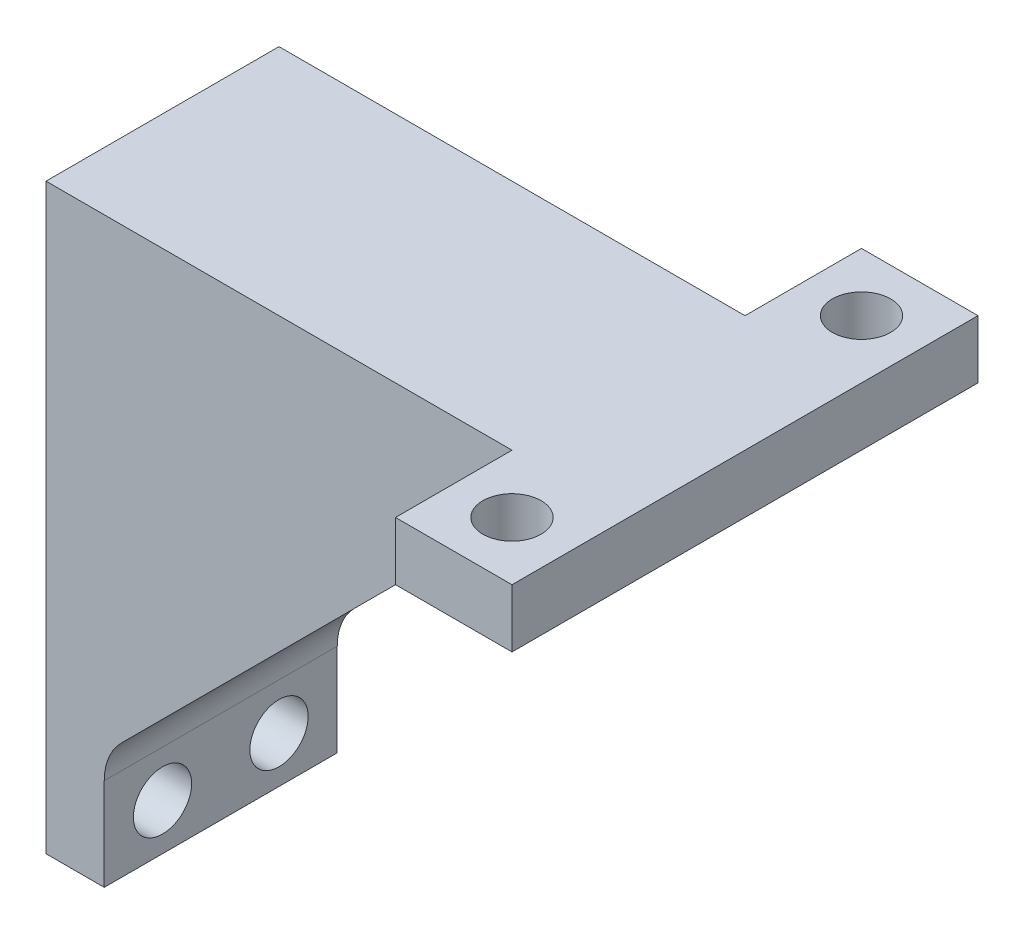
ISO-10303-21;
HEADER;
FILE_DESCRIPTION(('STEP AP214'),'2;1');
FILE_NAME('part.step','',(''),(''),'','','');
FILE_SCHEMA(('AUTOMOTIVE_DESIGN { 1 0 10303 214 1 1 1 1 }'));
ENDSEC;
DATA;
#1=APPLICATION_CONTEXT('core data for automotive mechanical design processes');
#2=APPLICATION_PROTOCOL_DEFINITION('international standard','automotive_design',2000,#1);
#3=PRODUCT_CONTEXT('',#1,'mechanical');
#4=PRODUCT('Part','Part','',(#3));
#5=PRODUCT_RELATED_PRODUCT_CATEGORY('part','',(#4));
#6=PRODUCT_DEFINITION_FORMATION('','',#4);
#7=PRODUCT_DEFINITION_CONTEXT('part definition',#1,'design');
#8=PRODUCT_DEFINITION('design','',#6,#7);
#9=PRODUCT_DEFINITION_SHAPE('','',#8);
#10=(LENGTH_UNIT() NAMED_UNIT(*) SI_UNIT(.MILLI.,.METRE.));
#11=(NAMED_UNIT(*) PLANE_ANGLE_UNIT() SI_UNIT($,.RADIAN.));
#12=(NAMED_UNIT(*) SI_UNIT($,.STERADIAN.) SOLID_ANGLE_UNIT());
#13=UNCERTAINTY_MEASURE_WITH_UNIT(LENGTH_MEASURE(1.E-05),#10,'distance_accuracy_value','');
#14=(GEOMETRIC_REPRESENTATION_CONTEXT(3) GLOBAL_UNCERTAINTY_ASSIGNED_CONTEXT((#13)) GLOBAL_UNIT_ASSIGNED_CONTEXT((#10,
#11,#12)) REPRESENTATION_CONTEXT('',''));
#15=CARTESIAN_POINT('',(0.,0.,0.));
#16=DIRECTION('',(0.,0.,1.));
#17=DIRECTION('',(1.,0.,0.));
#18=AXIS2_PLACEMENT_3D('',#15,#16,#17);
#19=CARTESIAN_POINT('',(70.,70.,40.));
#20=DIRECTION('',(-0.707106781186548,0.707106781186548,0.));
#21=DIRECTION('',(-0.707106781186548,-0.707106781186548,0.));
#22=AXIS2_PLACEMENT_3D('',#19,#20,#21);
#23=PLANE('',#22);
#24=DIRECTION('',(0.707106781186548,0.707106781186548,0.));
#25=VECTOR('',#24,1.);
#26=CARTESIAN_POINT('',(70.,70.,0.));
#27=LINE('',#26,#25);
#28=CARTESIAN_POINT('',(2.9289321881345,2.9289321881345,0.));
#29=VERTEX_POINT('',#28);
#30=CARTESIAN_POINT('',(67.0710678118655,67.0710678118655,0.));
#31=VERTEX_POINT('',#30);
#32=EDGE_CURVE('E208',#29,#31,#27,.T.);
#33=ORIENTED_EDGE('',*,*,#32,.T.);
#34=DIRECTION('',(0.,0.,-1.));
#35=VECTOR('',#34,1.);
#36=CARTESIAN_POINT('',(67.0710678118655,67.0710678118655,40.));
#37=LINE('',#36,#35);
#38=CARTESIAN_POINT('',(67.0710678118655,67.0710678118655,40.));
#39=VERTEX_POINT('',#38);
#40=EDGE_CURVE('E223',#31,#39,#37,.F.);
#41=ORIENTED_EDGE('',*,*,#40,.T.);
#42=DIRECTION('',(0.707106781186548,0.707106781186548,0.));
#43=VECTOR('',#42,1.);
#44=CARTESIAN_POINT('',(70.,70.,40.));
#45=LINE('',#44,#43);
#46=CARTESIAN_POINT('',(2.9289321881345,2.9289321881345,40.));
#47=VERTEX_POINT('',#46);
#48=EDGE_CURVE('E209',#47,#39,#45,.T.);
#49=ORIENTED_EDGE('',*,*,#48,.F.);
#50=DIRECTION('',(0.,0.,-1.));
#51=VECTOR('',#50,1.);
#52=CARTESIAN_POINT('',(2.92893218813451,2.92893218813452,0.));
#53=LINE('',#52,#51);
#54=EDGE_CURVE('E220',#47,#29,#53,.T.);
#55=ORIENTED_EDGE('',*,*,#54,.T.);
#56=EDGE_LOOP('',(#33,#41,#49,#55));
#57=FACE_BOUND('',#56,.T.);
#58=ADVANCED_FACE('F43',(#57),#23,.F.);
#59=CARTESIAN_POINT('',(0.,0.,40.));
#60=DIRECTION('',(0.,0.,-1.));
#61=DIRECTION('',(-1.,0.,0.));
#62=AXIS2_PLACEMENT_3D('',#59,#60,#61);
#63=PLANE('',#62);
#64=DIRECTION('',(0.,1.,0.));
#65=VECTOR('',#64,1.);
#66=CARTESIAN_POINT('',(0.,80.,40.));
#67=LINE('',#66,#65);
#68=CARTESIAN_POINT('',(0.,-20.,40.));
#69=VERTEX_POINT('',#68);
#70=CARTESIAN_POINT('',(0.,-4.14213562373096,40.));
#71=VERTEX_POINT('',#70);
#72=EDGE_CURVE('E156',#69,#71,#67,.T.);
#73=ORIENTED_EDGE('',*,*,#72,.T.);
#74=CARTESIAN_POINT('',(9.99999999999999,-4.14213562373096,40.));
#75=DIRECTION('',(0.,0.,-1.));
#76=DIRECTION('',(-1.,0.,0.));
#77=AXIS2_PLACEMENT_3D('',#74,#75,#76);
#78=CIRCLE('',#77,10.);
#79=EDGE_CURVE('E11',#71,#47,#78,.T.);
#80=ORIENTED_EDGE('',*,*,#79,.T.);
#81=ORIENTED_EDGE('',*,*,#48,.T.);
#82=CARTESIAN_POINT('',(74.142135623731,60.,40.));
#83=DIRECTION('',(0.,0.,-1.));
#84=DIRECTION('',(-1.,0.,0.));
#85=AXIS2_PLACEMENT_3D('',#82,#83,#84);
#86=CIRCLE('',#85,10.);
#87=CARTESIAN_POINT('',(74.142135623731,70.,40.));
#88=VERTEX_POINT('',#87);
#89=EDGE_CURVE('E229',#39,#88,#86,.T.);
#90=ORIENTED_EDGE('',*,*,#89,.T.);
#91=DIRECTION('',(1.,0.,0.));
#92=VECTOR('',#91,1.);
#93=CARTESIAN_POINT('',(0.,70.,40.));
#94=LINE('',#93,#92);
#95=CARTESIAN_POINT('',(70.,70.,40.));
#96=VERTEX_POINT('',#95);
#97=EDGE_CURVE('E58',#96,#88,#94,.T.);
#98=ORIENTED_EDGE('',*,*,#97,.F.);
#99=DIRECTION('',(0.,-1.,0.));
#100=VECTOR('',#99,1.);
#101=CARTESIAN_POINT('',(70.,80.,40.));
#102=LINE('',#101,#100);
#103=CARTESIAN_POINT('',(70.,80.,40.));
#104=VERTEX_POINT('',#103);
#105=EDGE_CURVE('E205',#104,#96,#102,.T.);
#106=ORIENTED_EDGE('',*,*,#105,.F.);
#107=DIRECTION('',(1.,0.,0.));
#108=VECTOR('',#107,1.);
#109=CARTESIAN_POINT('',(0.,80.,40.));
#110=LINE('',#109,#108);
#111=CARTESIAN_POINT('',(-10.,80.,40.));
#112=VERTEX_POINT('',#111);
#113=EDGE_CURVE('E168',#112,#104,#110,.T.);
#114=ORIENTED_EDGE('',*,*,#113,.F.);
#115=DIRECTION('',(0.,1.,0.));
#116=VECTOR('',#115,1.);
#117=CARTESIAN_POINT('',(-10.,80.,40.));
#118=LINE('',#117,#116);
#119=CARTESIAN_POINT('',(-10.,-20.,40.));
#120=VERTEX_POINT('',#119);
#121=EDGE_CURVE('E147',#120,#112,#118,.T.);
#122=ORIENTED_EDGE('',*,*,#121,.F.);
#123=DIRECTION('',(1.,0.,0.));
#124=VECTOR('',#123,1.);
#125=CARTESIAN_POINT('',(-10.,-20.,40.));
#126=LINE('',#125,#124);
#127=EDGE_CURVE('E143',#120,#69,#126,.T.);
#128=ORIENTED_EDGE('',*,*,#127,.T.);
#129=EDGE_LOOP('',(#73,#80,#81,#90,#98,#106,#114,#122,#128));
#130=FACE_BOUND('',#129,.T.);
#131=ADVANCED_FACE('F232',(#130),#63,.F.);
#132=CARTESIAN_POINT('',(0.,0.,0.));
#133=DIRECTION('',(0.,0.,-1.));
#134=DIRECTION('',(-1.,0.,0.));
#135=AXIS2_PLACEMENT_3D('',#132,#133,#134);
#136=PLANE('',#135);
#137=ORIENTED_EDGE('',*,*,#32,.F.);
#138=CARTESIAN_POINT('',(9.99999999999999,-4.14213562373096,0.));
#139=DIRECTION('',(0.,0.,-1.));
#140=DIRECTION('',(-1.,0.,0.));
#141=AXIS2_PLACEMENT_3D('',#138,#139,#140);
#142=CIRCLE('',#141,10.);
#143=CARTESIAN_POINT('',(0.,-4.14213562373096,0.));
#144=VERTEX_POINT('',#143);
#145=EDGE_CURVE('E51',#29,#144,#142,.F.);
#146=ORIENTED_EDGE('',*,*,#145,.T.);
#147=DIRECTION('',(0.,-1.,0.));
#148=VECTOR('',#147,1.);
#149=CARTESIAN_POINT('',(0.,80.,0.));
#150=LINE('',#149,#148);
#151=CARTESIAN_POINT('',(0.,-20.,0.));
#152=VERTEX_POINT('',#151);
#153=EDGE_CURVE('E159',#144,#152,#150,.T.);
#154=ORIENTED_EDGE('',*,*,#153,.T.);
#155=DIRECTION('',(1.,0.,0.));
#156=VECTOR('',#155,1.);
#157=CARTESIAN_POINT('',(-10.,-20.,0.));
#158=LINE('',#157,#156);
#159=CARTESIAN_POINT('',(-10.,-20.,0.));
#160=VERTEX_POINT('',#159);
#161=EDGE_CURVE('E141',#160,#152,#158,.T.);
#162=ORIENTED_EDGE('',*,*,#161,.F.);
#163=DIRECTION('',(0.,-1.,0.));
#164=VECTOR('',#163,1.);
#165=CARTESIAN_POINT('',(-10.,80.,0.));
#166=LINE('',#165,#164);
#167=CARTESIAN_POINT('',(-10.,80.,0.));
#168=VERTEX_POINT('',#167);
#169=EDGE_CURVE('E148',#168,#160,#166,.T.);
#170=ORIENTED_EDGE('',*,*,#169,.F.);
#171=DIRECTION('',(-1.,0.,0.));
#172=VECTOR('',#171,1.);
#173=CARTESIAN_POINT('',(0.,80.,0.));
#174=LINE('',#173,#172);
#175=CARTESIAN_POINT('',(70.,80.,0.));
#176=VERTEX_POINT('',#175);
#177=EDGE_CURVE('E181',#176,#168,#174,.T.);
#178=ORIENTED_EDGE('',*,*,#177,.F.);
#179=DIRECTION('',(0.,-1.,0.));
#180=VECTOR('',#179,1.);
#181=CARTESIAN_POINT('',(70.,80.,0.));
#182=LINE('',#181,#180);
#183=CARTESIAN_POINT('',(70.,70.,0.));
#184=VERTEX_POINT('',#183);
#185=EDGE_CURVE('E182',#176,#184,#182,.T.);
#186=ORIENTED_EDGE('',*,*,#185,.T.);
#187=DIRECTION('',(-1.,0.,0.));
#188=VECTOR('',#187,1.);
#189=CARTESIAN_POINT('',(0.,70.,0.));
#190=LINE('',#189,#188);
#191=CARTESIAN_POINT('',(74.142135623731,70.,0.));
#192=VERTEX_POINT('',#191);
#193=EDGE_CURVE('E218',#192,#184,#190,.T.);
#194=ORIENTED_EDGE('',*,*,#193,.F.);
#195=CARTESIAN_POINT('',(74.142135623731,60.,0.));
#196=DIRECTION('',(0.,0.,-1.));
#197=DIRECTION('',(-1.,0.,0.));
#198=AXIS2_PLACEMENT_3D('',#195,#196,#197);
#199=CIRCLE('',#198,10.);
#200=EDGE_CURVE('E227',#192,#31,#199,.F.);
#201=ORIENTED_EDGE('',*,*,#200,.T.);
#202=EDGE_LOOP('',(#137,#146,#154,#162,#170,#178,#186,#194,#201));
#203=FACE_BOUND('',#202,.T.);
#204=ADVANCED_FACE('F158',(#203),#136,.T.);
#205=CARTESIAN_POINT('',(0.,70.,0.));
#206=DIRECTION('',(0.,1.,0.));
#207=DIRECTION('',(0.,0.,1.));
#208=AXIS2_PLACEMENT_3D('',#205,#206,#207);
#209=PLANE('',#208);
#210=CARTESIAN_POINT('',(80.,70.,-10.));
#211=DIRECTION('',(0.,-1.,0.));
#212=DIRECTION('',(0.,0.,-1.));
#213=AXIS2_PLACEMENT_3D('',#210,#211,#212);
#214=CIRCLE('',#213,5.);
#215=CARTESIAN_POINT('',(80.,70.,-15.));
#216=VERTEX_POINT('',#215);
#217=EDGE_CURVE('E437',#216,#216,#214,.T.);
#218=ORIENTED_EDGE('',*,*,#217,.F.);
#219=EDGE_LOOP('',(#218));
#220=FACE_BOUND('',#219,.T.);
#221=CARTESIAN_POINT('',(80.,70.,50.));
#222=DIRECTION('',(0.,-1.,0.));
#223=DIRECTION('',(0.,0.,-1.));
#224=AXIS2_PLACEMENT_3D('',#221,#222,#223);
#225=CIRCLE('',#224,5.00000000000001);
#226=CARTESIAN_POINT('',(80.,70.,45.));
#227=VERTEX_POINT('',#226);
#228=EDGE_CURVE('E440',#227,#227,#225,.T.);
#229=ORIENTED_EDGE('',*,*,#228,.F.);
#230=EDGE_LOOP('',(#229));
#231=FACE_BOUND('',#230,.T.);
#232=DIRECTION('',(0.,0.,-1.));
#233=VECTOR('',#232,1.);
#234=CARTESIAN_POINT('',(74.142135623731,70.,0.));
#235=LINE('',#234,#233);
#236=EDGE_CURVE('E215',#88,#192,#235,.T.);
#237=ORIENTED_EDGE('',*,*,#236,.T.);
#238=ORIENTED_EDGE('',*,*,#193,.T.);
#239=DIRECTION('',(0.,0.,1.));
#240=VECTOR('',#239,1.);
#241=CARTESIAN_POINT('',(70.,70.,-20.));
#242=LINE('',#241,#240);
#243=CARTESIAN_POINT('',(70.,70.,-20.));
#244=VERTEX_POINT('',#243);
#245=EDGE_CURVE('E171',#244,#184,#242,.T.);
#246=ORIENTED_EDGE('',*,*,#245,.F.);
#247=DIRECTION('',(-1.,0.,0.));
#248=VECTOR('',#247,1.);
#249=CARTESIAN_POINT('',(90.,70.,-20.));
#250=LINE('',#249,#248);
#251=CARTESIAN_POINT('',(90.,70.,-20.));
#252=VERTEX_POINT('',#251);
#253=EDGE_CURVE('E187',#252,#244,#250,.T.);
#254=ORIENTED_EDGE('',*,*,#253,.F.);
#255=DIRECTION('',(0.,0.,-1.));
#256=VECTOR('',#255,1.);
#257=CARTESIAN_POINT('',(90.,70.,-20.));
#258=LINE('',#257,#256);
#259=CARTESIAN_POINT('',(90.,70.,60.));
#260=VERTEX_POINT('',#259);
#261=EDGE_CURVE('E185',#260,#252,#258,.T.);
#262=ORIENTED_EDGE('',*,*,#261,.F.);
#263=DIRECTION('',(1.,0.,0.));
#264=VECTOR('',#263,1.);
#265=CARTESIAN_POINT('',(90.,70.,60.));
#266=LINE('',#265,#264);
#267=CARTESIAN_POINT('',(70.,70.,60.));
#268=VERTEX_POINT('',#267);
#269=EDGE_CURVE('E163',#268,#260,#266,.T.);
#270=ORIENTED_EDGE('',*,*,#269,.F.);
#271=DIRECTION('',(0.,0.,1.));
#272=VECTOR('',#271,1.);
#273=CARTESIAN_POINT('',(70.,70.,40.));
#274=LINE('',#273,#272);
#275=EDGE_CURVE('E161',#96,#268,#274,.T.);
#276=ORIENTED_EDGE('',*,*,#275,.F.);
#277=ORIENTED_EDGE('',*,*,#97,.T.);
#278=EDGE_LOOP('',(#237,#238,#246,#254,#262,#270,#276,#277));
#279=FACE_BOUND('',#278,.T.);
#280=ADVANCED_FACE('F238',(#220,#231,#279),#209,.F.);
#281=CARTESIAN_POINT('',(70.,80.,40.));
#282=DIRECTION('',(1.,0.,0.));
#283=DIRECTION('',(0.,0.,-1.));
#284=AXIS2_PLACEMENT_3D('',#281,#282,#283);
#285=PLANE('',#284);
#286=ORIENTED_EDGE('',*,*,#275,.T.);
#287=DIRECTION('',(0.,-1.,0.));
#288=VECTOR('',#287,1.);
#289=CARTESIAN_POINT('',(70.,80.,60.));
#290=LINE('',#289,#288);
#291=CARTESIAN_POINT('',(70.,80.,60.));
#292=VERTEX_POINT('',#291);
#293=EDGE_CURVE('E202',#292,#268,#290,.T.);
#294=ORIENTED_EDGE('',*,*,#293,.F.);
#295=DIRECTION('',(0.,0.,1.));
#296=VECTOR('',#295,1.);
#297=CARTESIAN_POINT('',(70.,80.,40.));
#298=LINE('',#297,#296);
#299=EDGE_CURVE('E170',#104,#292,#298,.T.);
#300=ORIENTED_EDGE('',*,*,#299,.F.);
#301=ORIENTED_EDGE('',*,*,#105,.T.);
#302=EDGE_LOOP('',(#286,#294,#300,#301));
#303=FACE_BOUND('',#302,.T.);
#304=ADVANCED_FACE('F264',(#303),#285,.F.);
#305=CARTESIAN_POINT('',(90.,80.,60.));
#306=DIRECTION('',(0.,0.,-1.));
#307=DIRECTION('',(-1.,0.,0.));
#308=AXIS2_PLACEMENT_3D('',#305,#306,#307);
#309=PLANE('',#308);
#310=ORIENTED_EDGE('',*,*,#269,.T.);
#311=DIRECTION('',(0.,-1.,0.));
#312=VECTOR('',#311,1.);
#313=CARTESIAN_POINT('',(90.,80.,60.));
#314=LINE('',#313,#312);
#315=CARTESIAN_POINT('',(90.,80.,60.));
#316=VERTEX_POINT('',#315);
#317=EDGE_CURVE('E199',#316,#260,#314,.T.);
#318=ORIENTED_EDGE('',*,*,#317,.F.);
#319=DIRECTION('',(1.,0.,0.));
#320=VECTOR('',#319,1.);
#321=CARTESIAN_POINT('',(90.,80.,60.));
#322=LINE('',#321,#320);
#323=EDGE_CURVE('E173',#292,#316,#322,.T.);
#324=ORIENTED_EDGE('',*,*,#323,.F.);
#325=ORIENTED_EDGE('',*,*,#293,.T.);
#326=EDGE_LOOP('',(#310,#318,#324,#325));
#327=FACE_BOUND('',#326,.T.);
#328=ADVANCED_FACE('F260',(#327),#309,.F.);
#329=CARTESIAN_POINT('',(90.,80.,-20.));
#330=DIRECTION('',(-1.,0.,0.));
#331=DIRECTION('',(0.,0.,1.));
#332=AXIS2_PLACEMENT_3D('',#329,#330,#331);
#333=PLANE('',#332);
#334=ORIENTED_EDGE('',*,*,#261,.T.);
#335=DIRECTION('',(0.,-1.,0.));
#336=VECTOR('',#335,1.);
#337=CARTESIAN_POINT('',(90.,80.,-20.));
#338=LINE('',#337,#336);
#339=CARTESIAN_POINT('',(90.,80.,-20.));
#340=VERTEX_POINT('',#339);
#341=EDGE_CURVE('E196',#340,#252,#338,.T.);
#342=ORIENTED_EDGE('',*,*,#341,.F.);
#343=DIRECTION('',(0.,0.,-1.));
#344=VECTOR('',#343,1.);
#345=CARTESIAN_POINT('',(90.,80.,-20.));
#346=LINE('',#345,#344);
#347=EDGE_CURVE('E175',#316,#340,#346,.T.);
#348=ORIENTED_EDGE('',*,*,#347,.F.);
#349=ORIENTED_EDGE('',*,*,#317,.T.);
#350=EDGE_LOOP('',(#334,#342,#348,#349));
#351=FACE_BOUND('',#350,.T.);
#352=ADVANCED_FACE('F255',(#351),#333,.F.);
#353=CARTESIAN_POINT('',(90.,80.,-20.));
#354=DIRECTION('',(0.,0.,1.));
#355=DIRECTION('',(1.,0.,0.));
#356=AXIS2_PLACEMENT_3D('',#353,#354,#355);
#357=PLANE('',#356);
#358=ORIENTED_EDGE('',*,*,#253,.T.);
#359=DIRECTION('',(0.,-1.,0.));
#360=VECTOR('',#359,1.);
#361=CARTESIAN_POINT('',(70.,80.,-20.));
#362=LINE('',#361,#360);
#363=CARTESIAN_POINT('',(70.,80.,-20.));
#364=VERTEX_POINT('',#363);
#365=EDGE_CURVE('E193',#364,#244,#362,.T.);
#366=ORIENTED_EDGE('',*,*,#365,.F.);
#367=DIRECTION('',(-1.,0.,0.));
#368=VECTOR('',#367,1.);
#369=CARTESIAN_POINT('',(90.,80.,-20.));
#370=LINE('',#369,#368);
#371=EDGE_CURVE('E177',#340,#364,#370,.T.);
#372=ORIENTED_EDGE('',*,*,#371,.F.);
#373=ORIENTED_EDGE('',*,*,#341,.T.);
#374=EDGE_LOOP('',(#358,#366,#372,#373));
#375=FACE_BOUND('',#374,.T.);
#376=ADVANCED_FACE('F251',(#375),#357,.F.);
#377=CARTESIAN_POINT('',(70.,80.,-20.));
#378=DIRECTION('',(1.,0.,0.));
#379=DIRECTION('',(0.,0.,-1.));
#380=AXIS2_PLACEMENT_3D('',#377,#378,#379);
#381=PLANE('',#380);
#382=ORIENTED_EDGE('',*,*,#245,.T.);
#383=ORIENTED_EDGE('',*,*,#185,.F.);
#384=DIRECTION('',(0.,0.,1.));
#385=VECTOR('',#384,1.);
#386=CARTESIAN_POINT('',(70.,80.,-20.));
#387=LINE('',#386,#385);
#388=EDGE_CURVE('E179',#364,#176,#387,.T.);
#389=ORIENTED_EDGE('',*,*,#388,.F.);
#390=ORIENTED_EDGE('',*,*,#365,.T.);
#391=EDGE_LOOP('',(#382,#383,#389,#390));
#392=FACE_BOUND('',#391,.T.);
#393=ADVANCED_FACE('F246',(#392),#381,.F.);
#394=CARTESIAN_POINT('',(0.,80.,0.));
#395=DIRECTION('',(0.,1.,0.));
#396=DIRECTION('',(0.,0.,1.));
#397=AXIS2_PLACEMENT_3D('',#394,#395,#396);
#398=PLANE('',#397);
#399=CARTESIAN_POINT('',(80.,80.,-10.));
#400=DIRECTION('',(0.,-1.,0.));
#401=DIRECTION('',(0.,0.,-1.));
#402=AXIS2_PLACEMENT_3D('',#399,#400,#401);
#403=CIRCLE('',#402,5.);
#404=CARTESIAN_POINT('',(80.,80.,-15.));
#405=VERTEX_POINT('',#404);
#406=EDGE_CURVE('E272',#405,#405,#403,.T.);
#407=ORIENTED_EDGE('',*,*,#406,.T.);
#408=EDGE_LOOP('',(#407));
#409=FACE_BOUND('',#408,.T.);
#410=CARTESIAN_POINT('',(80.,80.,50.));
#411=DIRECTION('',(0.,-1.,0.));
#412=DIRECTION('',(0.,0.,-1.));
#413=AXIS2_PLACEMENT_3D('',#410,#411,#412);
#414=CIRCLE('',#413,5.00000000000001);
#415=CARTESIAN_POINT('',(80.,80.,45.));
#416=VERTEX_POINT('',#415);
#417=EDGE_CURVE('E427',#416,#416,#414,.T.);
#418=ORIENTED_EDGE('',*,*,#417,.T.);
#419=EDGE_LOOP('',(#418));
#420=FACE_BOUND('',#419,.T.);
#421=ORIENTED_EDGE('',*,*,#177,.T.);
#422=DIRECTION('',(0.,0.,-1.));
#423=VECTOR('',#422,1.);
#424=CARTESIAN_POINT('',(-10.,80.,0.));
#425=LINE('',#424,#423);
#426=EDGE_CURVE('E154',#112,#168,#425,.T.);
#427=ORIENTED_EDGE('',*,*,#426,.F.);
#428=ORIENTED_EDGE('',*,*,#113,.T.);
#429=ORIENTED_EDGE('',*,*,#299,.T.);
#430=ORIENTED_EDGE('',*,*,#323,.T.);
#431=ORIENTED_EDGE('',*,*,#347,.T.);
#432=ORIENTED_EDGE('',*,*,#371,.T.);
#433=ORIENTED_EDGE('',*,*,#388,.T.);
#434=EDGE_LOOP('',(#421,#427,#428,#429,#430,#431,#432,#433));
#435=FACE_BOUND('',#434,.T.);
#436=ADVANCED_FACE('F267',(#409,#420,#435),#398,.T.);
#437=CARTESIAN_POINT('',(-10.,-20.,0.));
#438=DIRECTION('',(0.,1.,0.));
#439=DIRECTION('',(0.,0.,1.));
#440=AXIS2_PLACEMENT_3D('',#437,#438,#439);
#441=PLANE('',#440);
#442=DIRECTION('',(0.,0.,1.));
#443=VECTOR('',#442,1.);
#444=CARTESIAN_POINT('',(0.,-20.,0.));
#445=LINE('',#444,#443);
#446=EDGE_CURVE('E271',#152,#69,#445,.T.);
#447=ORIENTED_EDGE('',*,*,#446,.T.);
#448=ORIENTED_EDGE('',*,*,#127,.F.);
#449=DIRECTION('',(0.,0.,1.));
#450=VECTOR('',#449,1.);
#451=CARTESIAN_POINT('',(-10.,-20.,0.));
#452=LINE('',#451,#450);
#453=EDGE_CURVE('E137',#160,#120,#452,.T.);
#454=ORIENTED_EDGE('',*,*,#453,.F.);
#455=ORIENTED_EDGE('',*,*,#161,.T.);
#456=EDGE_LOOP('',(#447,#448,#454,#455));
#457=FACE_BOUND('',#456,.T.);
#458=ADVANCED_FACE('F139',(#457),#441,.F.);
#459=CARTESIAN_POINT('',(-10.,0.,0.));
#460=DIRECTION('',(-1.,0.,0.));
#461=DIRECTION('',(0.,0.,1.));
#462=AXIS2_PLACEMENT_3D('',#459,#460,#461);
#463=PLANE('',#462);
#464=CARTESIAN_POINT('',(-10.,-12.0710678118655,10.));
#465=DIRECTION('',(1.,0.,0.));
#466=DIRECTION('',(0.,0.,-1.));
#467=AXIS2_PLACEMENT_3D('',#464,#465,#466);
#468=CIRCLE('',#467,5.);
#469=CARTESIAN_POINT('',(-10.,-12.0710678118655,4.99999999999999));
#470=VERTEX_POINT('',#469);
#471=EDGE_CURVE('E422',#470,#470,#468,.T.);
#472=ORIENTED_EDGE('',*,*,#471,.T.);
#473=EDGE_LOOP('',(#472));
#474=FACE_BOUND('',#473,.T.);
#475=CARTESIAN_POINT('',(-10.,-12.0710678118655,30.));
#476=DIRECTION('',(1.,0.,0.));
#477=DIRECTION('',(0.,0.,-1.));
#478=AXIS2_PLACEMENT_3D('',#475,#476,#477);
#479=CIRCLE('',#478,5.00000000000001);
#480=CARTESIAN_POINT('',(-10.,-12.0710678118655,25.));
#481=VERTEX_POINT('',#480);
#482=EDGE_CURVE('E430',#481,#481,#479,.T.);
#483=ORIENTED_EDGE('',*,*,#482,.T.);
#484=EDGE_LOOP('',(#483));
#485=FACE_BOUND('',#484,.T.);
#486=ORIENTED_EDGE('',*,*,#169,.T.);
#487=ORIENTED_EDGE('',*,*,#453,.T.);
#488=ORIENTED_EDGE('',*,*,#121,.T.);
#489=ORIENTED_EDGE('',*,*,#426,.T.);
#490=EDGE_LOOP('',(#486,#487,#488,#489));
#491=FACE_BOUND('',#490,.T.);
#492=ADVANCED_FACE('F152',(#474,#485,#491),#463,.T.);
#493=CARTESIAN_POINT('',(0.,0.,0.));
#494=DIRECTION('',(-1.,0.,0.));
#495=DIRECTION('',(0.,0.,1.));
#496=AXIS2_PLACEMENT_3D('',#493,#494,#495);
#497=PLANE('',#496);
#498=CARTESIAN_POINT('',(0.,-12.0710678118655,10.));
#499=DIRECTION('',(1.,0.,0.));
#500=DIRECTION('',(0.,0.,-1.));
#501=AXIS2_PLACEMENT_3D('',#498,#499,#500);
#502=CIRCLE('',#501,5.);
#503=CARTESIAN_POINT('',(0.,-12.0710678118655,4.99999999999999));
#504=VERTEX_POINT('',#503);
#505=EDGE_CURVE('E424',#504,#504,#502,.T.);
#506=ORIENTED_EDGE('',*,*,#505,.F.);
#507=EDGE_LOOP('',(#506));
#508=FACE_BOUND('',#507,.T.);
#509=CARTESIAN_POINT('',(0.,-12.0710678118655,30.));
#510=DIRECTION('',(1.,0.,0.));
#511=DIRECTION('',(0.,0.,-1.));
#512=AXIS2_PLACEMENT_3D('',#509,#510,#511);
#513=CIRCLE('',#512,5.00000000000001);
#514=CARTESIAN_POINT('',(0.,-12.0710678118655,25.));
#515=VERTEX_POINT('',#514);
#516=EDGE_CURVE('E425',#515,#515,#513,.T.);
#517=ORIENTED_EDGE('',*,*,#516,.F.);
#518=EDGE_LOOP('',(#517));
#519=FACE_BOUND('',#518,.T.);
#520=ORIENTED_EDGE('',*,*,#153,.F.);
#521=DIRECTION('',(0.,0.,-1.));
#522=VECTOR('',#521,1.);
#523=CARTESIAN_POINT('',(0.,-4.14213562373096,40.));
#524=LINE('',#523,#522);
#525=EDGE_CURVE('E225',#144,#71,#524,.F.);
#526=ORIENTED_EDGE('',*,*,#525,.T.);
#527=ORIENTED_EDGE('',*,*,#72,.F.);
#528=ORIENTED_EDGE('',*,*,#446,.F.);
#529=EDGE_LOOP('',(#520,#526,#527,#528));
#530=FACE_BOUND('',#529,.T.);
#531=ADVANCED_FACE('F289',(#508,#519,#530),#497,.F.);
#532=CARTESIAN_POINT('',(74.142135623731,60.,0.));
#533=DIRECTION('',(0.,0.,1.));
#534=DIRECTION('',(1.,0.,0.));
#535=AXIS2_PLACEMENT_3D('',#532,#533,#534);
#536=CYLINDRICAL_SURFACE('',#535,10.);
#537=ORIENTED_EDGE('',*,*,#89,.F.);
#538=ORIENTED_EDGE('',*,*,#40,.F.);
#539=ORIENTED_EDGE('',*,*,#200,.F.);
#540=ORIENTED_EDGE('',*,*,#236,.F.);
#541=EDGE_LOOP('',(#537,#538,#539,#540));
#542=FACE_BOUND('',#541,.T.);
#543=ADVANCED_FACE('F240',(#542),#536,.F.);
#544=CARTESIAN_POINT('',(9.99999999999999,-4.14213562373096,40.));
#545=DIRECTION('',(0.,0.,1.));
#546=DIRECTION('',(1.,0.,0.));
#547=AXIS2_PLACEMENT_3D('',#544,#545,#546);
#548=CYLINDRICAL_SURFACE('',#547,10.);
#549=ORIENTED_EDGE('',*,*,#79,.F.);
#550=ORIENTED_EDGE('',*,*,#525,.F.);
#551=ORIENTED_EDGE('',*,*,#145,.F.);
#552=ORIENTED_EDGE('',*,*,#54,.F.);
#553=EDGE_LOOP('',(#549,#550,#551,#552));
#554=FACE_BOUND('',#553,.T.);
#555=ADVANCED_FACE('F45',(#554),#548,.F.);
#556=CARTESIAN_POINT('',(80.,80.,50.));
#557=DIRECTION('',(0.,-1.,0.));
#558=DIRECTION('',(0.,0.,-1.));
#559=AXIS2_PLACEMENT_3D('',#556,#557,#558);
#560=CYLINDRICAL_SURFACE('',#559,5.00000000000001);
#561=ORIENTED_EDGE('',*,*,#417,.F.);
#562=EDGE_LOOP('',(#561));
#563=FACE_BOUND('',#562,.T.);
#564=ORIENTED_EDGE('',*,*,#228,.T.);
#565=EDGE_LOOP('',(#564));
#566=FACE_BOUND('',#565,.T.);
#567=ADVANCED_FACE('F294',(#563,#566),#560,.F.);
#568=CARTESIAN_POINT('',(80.,80.,-10.));
#569=DIRECTION('',(0.,-1.,0.));
#570=DIRECTION('',(0.,0.,-1.));
#571=AXIS2_PLACEMENT_3D('',#568,#569,#570);
#572=CYLINDRICAL_SURFACE('',#571,5.);
#573=ORIENTED_EDGE('',*,*,#406,.F.);
#574=EDGE_LOOP('',(#573));
#575=FACE_BOUND('',#574,.T.);
#576=ORIENTED_EDGE('',*,*,#217,.T.);
#577=EDGE_LOOP('',(#576));
#578=FACE_BOUND('',#577,.T.);
#579=ADVANCED_FACE('F389',(#575,#578),#572,.F.);
#580=CARTESIAN_POINT('',(-10.,-12.0710678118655,30.));
#581=DIRECTION('',(1.,0.,0.));
#582=DIRECTION('',(0.,0.,-1.));
#583=AXIS2_PLACEMENT_3D('',#580,#581,#582);
#584=CYLINDRICAL_SURFACE('',#583,5.00000000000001);
#585=ORIENTED_EDGE('',*,*,#482,.F.);
#586=EDGE_LOOP('',(#585));
#587=FACE_BOUND('',#586,.T.);
#588=ORIENTED_EDGE('',*,*,#516,.T.);
#589=EDGE_LOOP('',(#588));
#590=FACE_BOUND('',#589,.T.);
#591=ADVANCED_FACE('F397',(#587,#590),#584,.F.);
#592=CARTESIAN_POINT('',(-10.,-12.0710678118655,10.));
#593=DIRECTION('',(1.,0.,0.));
#594=DIRECTION('',(0.,0.,-1.));
#595=AXIS2_PLACEMENT_3D('',#592,#593,#594);
#596=CYLINDRICAL_SURFACE('',#595,5.);
#597=ORIENTED_EDGE('',*,*,#471,.F.);
#598=EDGE_LOOP('',(#597));
#599=FACE_BOUND('',#598,.T.);
#600=ORIENTED_EDGE('',*,*,#505,.T.);
#601=EDGE_LOOP('',(#600));
#602=FACE_BOUND('',#601,.T.);
#603=ADVANCED_FACE('F406',(#599,#602),#596,.F.);
#604=CLOSED_SHELL('',(#58,#131,#204,#280,#304,#328,#352,#376,#393,#436,#458,#492,#531,#543,#555,
#567,#579,#591,#603));
#605=MANIFOLD_SOLID_BREP('B2',#604);
#606=ADVANCED_BREP_SHAPE_REPRESENTATION('',(#18,#605),#14);
#607=SHAPE_DEFINITION_REPRESENTATION(#9,#606);
ENDSEC;
END-ISO-10303-21;
